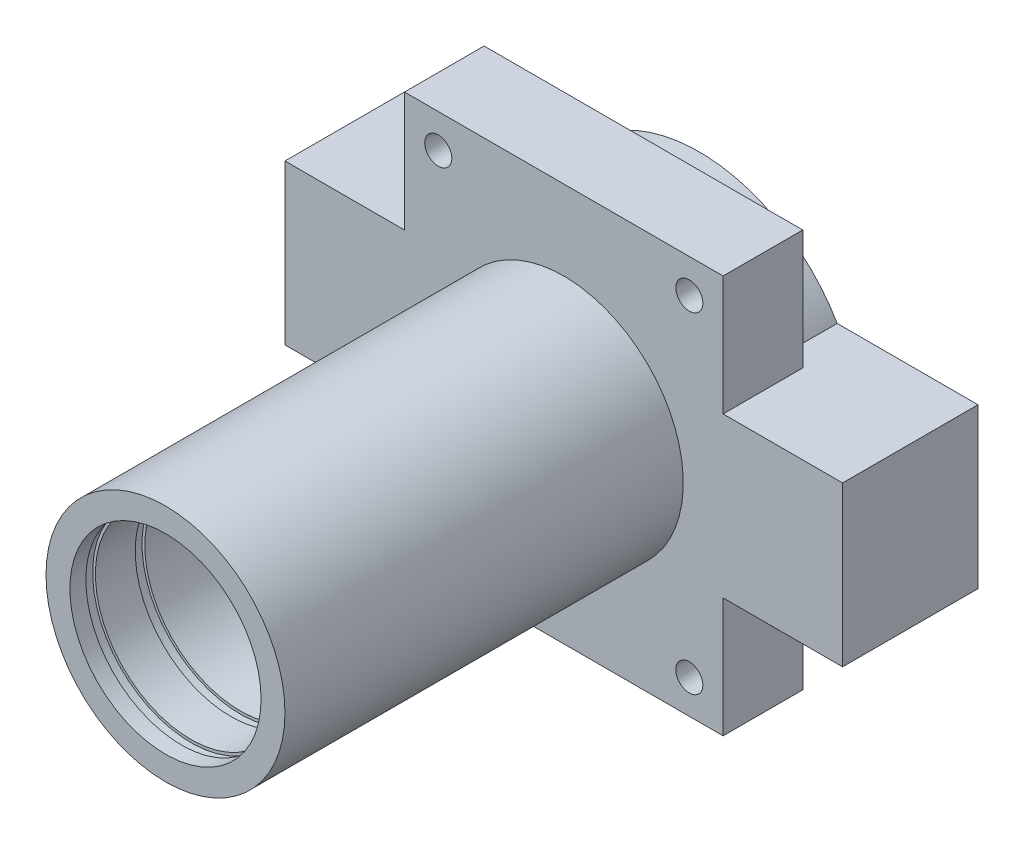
ISO-10303-21;
HEADER;
FILE_DESCRIPTION(('STEP AP214'),'2;1');
FILE_NAME('part.step','',(''),(''),'','','');
FILE_SCHEMA(('AUTOMOTIVE_DESIGN { 1 0 10303 214 1 1 1 1 }'));
ENDSEC;
DATA;
#1=APPLICATION_CONTEXT('core data for automotive mechanical design processes');
#2=APPLICATION_PROTOCOL_DEFINITION('international standard','automotive_design',2000,#1);
#3=PRODUCT_CONTEXT('',#1,'mechanical');
#4=PRODUCT('Part','Part','',(#3));
#5=PRODUCT_RELATED_PRODUCT_CATEGORY('part','',(#4));
#6=PRODUCT_DEFINITION_FORMATION('','',#4);
#7=PRODUCT_DEFINITION_CONTEXT('part definition',#1,'design');
#8=PRODUCT_DEFINITION('design','',#6,#7);
#9=PRODUCT_DEFINITION_SHAPE('','',#8);
#10=(LENGTH_UNIT() NAMED_UNIT(*) SI_UNIT(.MILLI.,.METRE.));
#11=(NAMED_UNIT(*) PLANE_ANGLE_UNIT() SI_UNIT($,.RADIAN.));
#12=(NAMED_UNIT(*) SI_UNIT($,.STERADIAN.) SOLID_ANGLE_UNIT());
#13=UNCERTAINTY_MEASURE_WITH_UNIT(LENGTH_MEASURE(1.E-05),#10,'distance_accuracy_value','');
#14=(GEOMETRIC_REPRESENTATION_CONTEXT(3) GLOBAL_UNCERTAINTY_ASSIGNED_CONTEXT((#13)) GLOBAL_UNIT_ASSIGNED_CONTEXT((#10,
#11,#12)) REPRESENTATION_CONTEXT('',''));
#15=CARTESIAN_POINT('',(0.,0.,0.));
#16=DIRECTION('',(0.,0.,1.));
#17=DIRECTION('',(1.,0.,0.));
#18=AXIS2_PLACEMENT_3D('',#15,#16,#17);
#19=CARTESIAN_POINT('',(20.,25.,60.));
#20=DIRECTION('',(0.,0.,-1.));
#21=DIRECTION('',(-1.,0.,0.));
#22=AXIS2_PLACEMENT_3D('',#19,#20,#21);
#23=CYLINDRICAL_SURFACE('',#22,12.);
#24=CARTESIAN_POINT('',(20.,25.,10.));
#25=DIRECTION('',(0.,0.,1.));
#26=DIRECTION('',(1.,0.,0.));
#27=AXIS2_PLACEMENT_3D('',#24,#25,#26);
#28=CIRCLE('',#27,12.);
#29=CARTESIAN_POINT('',(32.,25.,10.));
#30=VERTEX_POINT('',#29);
#31=EDGE_CURVE('E352',#30,#30,#28,.T.);
#32=ORIENTED_EDGE('',*,*,#31,.F.);
#33=EDGE_LOOP('',(#32));
#34=FACE_BOUND('',#33,.T.);
#35=CARTESIAN_POINT('',(20.,25.,50.6));
#36=DIRECTION('',(0.,0.,1.));
#37=DIRECTION('',(1.,0.,0.));
#38=AXIS2_PLACEMENT_3D('',#35,#36,#37);
#39=CIRCLE('',#38,12.);
#40=CARTESIAN_POINT('',(32.,25.,50.6));
#41=VERTEX_POINT('',#40);
#42=EDGE_CURVE('E46',#41,#41,#39,.T.);
#43=ORIENTED_EDGE('',*,*,#42,.T.);
#44=EDGE_LOOP('',(#43));
#45=FACE_BOUND('',#44,.T.);
#46=ADVANCED_FACE('F42',(#34,#45),#23,.F.);
#47=CARTESIAN_POINT('',(20.,25.,51.8));
#48=DIRECTION('',(0.,0.,1.));
#49=DIRECTION('',(1.,0.,0.));
#50=AXIS2_PLACEMENT_3D('',#47,#48,#49);
#51=CIRCLE('',#50,12.);
#52=CARTESIAN_POINT('',(32.,25.,51.8));
#53=VERTEX_POINT('',#52);
#54=EDGE_CURVE('E353',#53,#53,#51,.T.);
#55=ORIENTED_EDGE('',*,*,#54,.F.);
#56=EDGE_LOOP('',(#55));
#57=FACE_BOUND('',#56,.T.);
#58=CARTESIAN_POINT('',(20.,25.,56.8));
#59=DIRECTION('',(0.,0.,1.));
#60=DIRECTION('',(1.,0.,0.));
#61=AXIS2_PLACEMENT_3D('',#58,#59,#60);
#62=CIRCLE('',#61,12.);
#63=CARTESIAN_POINT('',(32.,25.,56.8));
#64=VERTEX_POINT('',#63);
#65=EDGE_CURVE('E349',#64,#64,#62,.T.);
#66=ORIENTED_EDGE('',*,*,#65,.T.);
#67=EDGE_LOOP('',(#66));
#68=FACE_BOUND('',#67,.T.);
#69=ADVANCED_FACE('F458',(#57,#68),#23,.F.);
#70=CARTESIAN_POINT('',(0.,0.,10.));
#71=DIRECTION('',(0.,0.,-1.));
#72=DIRECTION('',(-1.,0.,0.));
#73=AXIS2_PLACEMENT_3D('',#70,#71,#72);
#74=PLANE('',#73);
#75=CARTESIAN_POINT('',(20.,25.,10.));
#76=DIRECTION('',(0.,0.,-1.));
#77=DIRECTION('',(-1.,0.,0.));
#78=AXIS2_PLACEMENT_3D('',#75,#76,#77);
#79=CIRCLE('',#78,7.5);
#80=CARTESIAN_POINT('',(12.5,25.,10.));
#81=VERTEX_POINT('',#80);
#82=EDGE_CURVE('E303',#81,#81,#79,.T.);
#83=ORIENTED_EDGE('',*,*,#82,.T.);
#84=EDGE_LOOP('',(#83));
#85=FACE_BOUND('',#84,.T.);
#86=ORIENTED_EDGE('',*,*,#31,.T.);
#87=EDGE_LOOP('',(#86));
#88=FACE_BOUND('',#87,.T.);
#89=ADVANCED_FACE('F395',(#85,#88),#74,.F.);
#90=CARTESIAN_POINT('',(0.,0.,0.));
#91=DIRECTION('',(0.,0.,-1.));
#92=DIRECTION('',(-1.,0.,0.));
#93=AXIS2_PLACEMENT_3D('',#90,#91,#92);
#94=PLANE('',#93);
#95=CARTESIAN_POINT('',(4.24264068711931,4.24264068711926,0.));
#96=DIRECTION('',(0.,0.,-1.));
#97=DIRECTION('',(-1.,0.,0.));
#98=AXIS2_PLACEMENT_3D('',#95,#96,#97);
#99=CIRCLE('',#98,3.15);
#100=CARTESIAN_POINT('',(1.09264068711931,4.24264068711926,0.));
#101=VERTEX_POINT('',#100);
#102=EDGE_CURVE('E186',#101,#101,#99,.T.);
#103=ORIENTED_EDGE('',*,*,#102,.F.);
#104=EDGE_LOOP('',(#103));
#105=FACE_BOUND('',#104,.T.);
#106=CARTESIAN_POINT('',(35.7573593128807,4.24264068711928,0.));
#107=DIRECTION('',(0.,0.,-1.));
#108=DIRECTION('',(-1.,0.,0.));
#109=AXIS2_PLACEMENT_3D('',#106,#107,#108);
#110=CIRCLE('',#109,3.15);
#111=CARTESIAN_POINT('',(32.6073593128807,4.24264068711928,0.));
#112=VERTEX_POINT('',#111);
#113=EDGE_CURVE('E195',#112,#112,#110,.T.);
#114=ORIENTED_EDGE('',*,*,#113,.F.);
#115=EDGE_LOOP('',(#114));
#116=FACE_BOUND('',#115,.T.);
#117=CARTESIAN_POINT('',(20.,25.,0.));
#118=DIRECTION('',(0.,0.,-1.));
#119=DIRECTION('',(-1.,0.,0.));
#120=AXIS2_PLACEMENT_3D('',#117,#118,#119);
#121=CIRCLE('',#120,20.);
#122=CARTESIAN_POINT('',(37.3205080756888,15.,0.));
#123=VERTEX_POINT('',#122);
#124=CARTESIAN_POINT('',(2.67949192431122,15.,0.));
#125=VERTEX_POINT('',#124);
#126=EDGE_CURVE('E305',#123,#125,#121,.T.);
#127=ORIENTED_EDGE('',*,*,#126,.F.);
#128=DIRECTION('',(-1.,0.,0.));
#129=VECTOR('',#128,1.);
#130=CARTESIAN_POINT('',(40.,15.,0.));
#131=LINE('',#130,#129);
#132=CARTESIAN_POINT('',(40.,15.,0.));
#133=VERTEX_POINT('',#132);
#134=EDGE_CURVE('E222',#133,#123,#131,.T.);
#135=ORIENTED_EDGE('',*,*,#134,.F.);
#136=DIRECTION('',(0.,1.,0.));
#137=VECTOR('',#136,1.);
#138=CARTESIAN_POINT('',(40.,0.,0.));
#139=LINE('',#138,#137);
#140=CARTESIAN_POINT('',(40.,0.,0.));
#141=VERTEX_POINT('',#140);
#142=EDGE_CURVE('E328',#141,#133,#139,.T.);
#143=ORIENTED_EDGE('',*,*,#142,.F.);
#144=DIRECTION('',(1.,0.,0.));
#145=VECTOR('',#144,1.);
#146=CARTESIAN_POINT('',(0.,0.,0.));
#147=LINE('',#146,#145);
#148=CARTESIAN_POINT('',(0.,0.,0.));
#149=VERTEX_POINT('',#148);
#150=EDGE_CURVE('E325',#149,#141,#147,.T.);
#151=ORIENTED_EDGE('',*,*,#150,.F.);
#152=DIRECTION('',(0.,-1.,0.));
#153=VECTOR('',#152,1.);
#154=CARTESIAN_POINT('',(0.,0.,0.));
#155=LINE('',#154,#153);
#156=CARTESIAN_POINT('',(0.,15.,0.));
#157=VERTEX_POINT('',#156);
#158=EDGE_CURVE('E308',#157,#149,#155,.T.);
#159=ORIENTED_EDGE('',*,*,#158,.F.);
#160=DIRECTION('',(1.,0.,0.));
#161=VECTOR('',#160,1.);
#162=CARTESIAN_POINT('',(0.,15.,0.));
#163=LINE('',#162,#161);
#164=EDGE_CURVE('E238',#157,#125,#163,.T.);
#165=ORIENTED_EDGE('',*,*,#164,.T.);
#166=EDGE_LOOP('',(#127,#135,#143,#151,#159,#165));
#167=FACE_BOUND('',#166,.T.);
#168=ADVANCED_FACE('F428',(#105,#116,#167),#94,.T.);
#169=CARTESIAN_POINT('',(20.,25.,-7.));
#170=DIRECTION('',(0.,0.,1.));
#171=DIRECTION('',(1.,0.,0.));
#172=AXIS2_PLACEMENT_3D('',#169,#170,#171);
#173=CYLINDRICAL_SURFACE('',#172,20.);
#174=DIRECTION('',(0.,0.,1.));
#175=VECTOR('',#174,1.);
#176=CARTESIAN_POINT('',(37.3205080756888,15.,-7.));
#177=LINE('',#176,#175);
#178=CARTESIAN_POINT('',(37.3205080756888,15.,-7.));
#179=VERTEX_POINT('',#178);
#180=EDGE_CURVE('E236',#179,#123,#177,.T.);
#181=ORIENTED_EDGE('',*,*,#180,.T.);
#182=ORIENTED_EDGE('',*,*,#126,.T.);
#183=DIRECTION('',(0.,0.,1.));
#184=VECTOR('',#183,1.);
#185=CARTESIAN_POINT('',(2.67949192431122,15.,-7.));
#186=LINE('',#185,#184);
#187=CARTESIAN_POINT('',(2.67949192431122,15.,-7.));
#188=VERTEX_POINT('',#187);
#189=EDGE_CURVE('E248',#188,#125,#186,.T.);
#190=ORIENTED_EDGE('',*,*,#189,.F.);
#191=CARTESIAN_POINT('',(20.,25.,-7.));
#192=DIRECTION('',(0.,0.,-1.));
#193=DIRECTION('',(-1.,0.,0.));
#194=AXIS2_PLACEMENT_3D('',#191,#192,#193);
#195=CIRCLE('',#194,20.);
#196=EDGE_CURVE('E59',#179,#188,#195,.T.);
#197=ORIENTED_EDGE('',*,*,#196,.F.);
#198=EDGE_LOOP('',(#181,#182,#190,#197));
#199=FACE_BOUND('',#198,.T.);
#200=ADVANCED_FACE('F424',(#199),#173,.T.);
#201=CARTESIAN_POINT('',(40.,0.,10.));
#202=DIRECTION('',(-1.,0.,0.));
#203=DIRECTION('',(0.,0.,1.));
#204=AXIS2_PLACEMENT_3D('',#201,#202,#203);
#205=PLANE('',#204);
#206=DIRECTION('',(0.,1.,0.));
#207=VECTOR('',#206,1.);
#208=CARTESIAN_POINT('',(40.,0.,10.));
#209=LINE('',#208,#207);
#210=CARTESIAN_POINT('',(40.,35.,10.));
#211=VERTEX_POINT('',#210);
#212=CARTESIAN_POINT('',(40.,50.,10.));
#213=VERTEX_POINT('',#212);
#214=EDGE_CURVE('E315',#211,#213,#209,.T.);
#215=ORIENTED_EDGE('',*,*,#214,.F.);
#216=DIRECTION('',(0.,0.,-1.));
#217=VECTOR('',#216,1.);
#218=CARTESIAN_POINT('',(40.,35.,0.));
#219=LINE('',#218,#217);
#220=CARTESIAN_POINT('',(40.,35.,0.));
#221=VERTEX_POINT('',#220);
#222=EDGE_CURVE('E257',#211,#221,#219,.T.);
#223=ORIENTED_EDGE('',*,*,#222,.T.);
#224=CARTESIAN_POINT('',(40.,50.,0.));
#225=VERTEX_POINT('',#224);
#226=EDGE_CURVE('E327',#221,#225,#139,.T.);
#227=ORIENTED_EDGE('',*,*,#226,.T.);
#228=DIRECTION('',(0.,0.,-1.));
#229=VECTOR('',#228,1.);
#230=CARTESIAN_POINT('',(40.,50.,10.));
#231=LINE('',#230,#229);
#232=EDGE_CURVE('E335',#213,#225,#231,.T.);
#233=ORIENTED_EDGE('',*,*,#232,.F.);
#234=EDGE_LOOP('',(#215,#223,#227,#233));
#235=FACE_BOUND('',#234,.T.);
#236=ADVANCED_FACE('F456',(#235),#205,.F.);
#237=CARTESIAN_POINT('',(0.,0.,10.));
#238=DIRECTION('',(1.,0.,0.));
#239=DIRECTION('',(0.,0.,-1.));
#240=AXIS2_PLACEMENT_3D('',#237,#238,#239);
#241=PLANE('',#240);
#242=DIRECTION('',(0.,0.,-1.));
#243=VECTOR('',#242,1.);
#244=CARTESIAN_POINT('',(0.,35.,0.));
#245=LINE('',#244,#243);
#246=CARTESIAN_POINT('',(0.,35.,10.));
#247=VERTEX_POINT('',#246);
#248=CARTESIAN_POINT('',(0.,35.,0.));
#249=VERTEX_POINT('',#248);
#250=EDGE_CURVE('E276',#247,#249,#245,.T.);
#251=ORIENTED_EDGE('',*,*,#250,.F.);
#252=DIRECTION('',(0.,-1.,0.));
#253=VECTOR('',#252,1.);
#254=CARTESIAN_POINT('',(0.,0.,10.));
#255=LINE('',#254,#253);
#256=CARTESIAN_POINT('',(0.,50.,10.));
#257=VERTEX_POINT('',#256);
#258=EDGE_CURVE('E309',#257,#247,#255,.T.);
#259=ORIENTED_EDGE('',*,*,#258,.F.);
#260=DIRECTION('',(0.,0.,-1.));
#261=VECTOR('',#260,1.);
#262=CARTESIAN_POINT('',(0.,50.,10.));
#263=LINE('',#262,#261);
#264=CARTESIAN_POINT('',(0.,50.,0.));
#265=VERTEX_POINT('',#264);
#266=EDGE_CURVE('E321',#257,#265,#263,.T.);
#267=ORIENTED_EDGE('',*,*,#266,.T.);
#268=EDGE_CURVE('E322',#265,#249,#155,.T.);
#269=ORIENTED_EDGE('',*,*,#268,.T.);
#270=EDGE_LOOP('',(#251,#259,#267,#269));
#271=FACE_BOUND('',#270,.T.);
#272=ADVANCED_FACE('F44',(#271),#241,.F.);
#273=DIRECTION('',(0.,0.,1.));
#274=VECTOR('',#273,1.);
#275=CARTESIAN_POINT('',(0.,15.,10.));
#276=LINE('',#275,#274);
#277=CARTESIAN_POINT('',(0.,15.,10.));
#278=VERTEX_POINT('',#277);
#279=EDGE_CURVE('E280',#157,#278,#276,.T.);
#280=ORIENTED_EDGE('',*,*,#279,.F.);
#281=ORIENTED_EDGE('',*,*,#158,.T.);
#282=DIRECTION('',(0.,0.,-1.));
#283=VECTOR('',#282,1.);
#284=CARTESIAN_POINT('',(0.,0.,10.));
#285=LINE('',#284,#283);
#286=CARTESIAN_POINT('',(0.,0.,10.));
#287=VERTEX_POINT('',#286);
#288=EDGE_CURVE('E341',#287,#149,#285,.T.);
#289=ORIENTED_EDGE('',*,*,#288,.F.);
#290=EDGE_CURVE('E313',#278,#287,#255,.T.);
#291=ORIENTED_EDGE('',*,*,#290,.F.);
#292=EDGE_LOOP('',(#280,#281,#289,#291));
#293=FACE_BOUND('',#292,.T.);
#294=ADVANCED_FACE('F447',(#293),#241,.F.);
#295=CARTESIAN_POINT('',(20.,25.,10.));
#296=DIRECTION('',(0.,0.,-1.));
#297=DIRECTION('',(-1.,0.,0.));
#298=AXIS2_PLACEMENT_3D('',#295,#296,#297);
#299=CYLINDRICAL_SURFACE('',#298,7.5);
#300=ORIENTED_EDGE('',*,*,#82,.F.);
#301=EDGE_LOOP('',(#300));
#302=FACE_BOUND('',#301,.T.);
#303=CARTESIAN_POINT('',(20.,25.,2.));
#304=DIRECTION('',(0.,0.,-1.));
#305=DIRECTION('',(-1.,0.,0.));
#306=AXIS2_PLACEMENT_3D('',#303,#304,#305);
#307=CIRCLE('',#306,7.5);
#308=CARTESIAN_POINT('',(12.5,25.,2.));
#309=VERTEX_POINT('',#308);
#310=EDGE_CURVE('E298',#309,#309,#307,.F.);
#311=ORIENTED_EDGE('',*,*,#310,.F.);
#312=EDGE_LOOP('',(#311));
#313=FACE_BOUND('',#312,.T.);
#314=ADVANCED_FACE('F449',(#302,#313),#299,.F.);
#315=CARTESIAN_POINT('',(0.,0.,10.));
#316=DIRECTION('',(0.,1.,0.));
#317=DIRECTION('',(0.,0.,1.));
#318=AXIS2_PLACEMENT_3D('',#315,#316,#317);
#319=PLANE('',#318);
#320=ORIENTED_EDGE('',*,*,#150,.T.);
#321=DIRECTION('',(0.,0.,-1.));
#322=VECTOR('',#321,1.);
#323=CARTESIAN_POINT('',(40.,0.,10.));
#324=LINE('',#323,#322);
#325=CARTESIAN_POINT('',(40.,0.,10.));
#326=VERTEX_POINT('',#325);
#327=EDGE_CURVE('E338',#326,#141,#324,.T.);
#328=ORIENTED_EDGE('',*,*,#327,.F.);
#329=DIRECTION('',(1.,0.,0.));
#330=VECTOR('',#329,1.);
#331=CARTESIAN_POINT('',(0.,0.,10.));
#332=LINE('',#331,#330);
#333=EDGE_CURVE('E312',#287,#326,#332,.T.);
#334=ORIENTED_EDGE('',*,*,#333,.F.);
#335=ORIENTED_EDGE('',*,*,#288,.T.);
#336=EDGE_LOOP('',(#320,#328,#334,#335));
#337=FACE_BOUND('',#336,.T.);
#338=ADVANCED_FACE('F443',(#337),#319,.F.);
#339=ORIENTED_EDGE('',*,*,#142,.T.);
#340=DIRECTION('',(0.,0.,1.));
#341=VECTOR('',#340,1.);
#342=CARTESIAN_POINT('',(40.,15.,10.));
#343=LINE('',#342,#341);
#344=CARTESIAN_POINT('',(40.,15.,10.));
#345=VERTEX_POINT('',#344);
#346=EDGE_CURVE('E261',#133,#345,#343,.T.);
#347=ORIENTED_EDGE('',*,*,#346,.T.);
#348=EDGE_CURVE('E316',#326,#345,#209,.T.);
#349=ORIENTED_EDGE('',*,*,#348,.F.);
#350=ORIENTED_EDGE('',*,*,#327,.T.);
#351=EDGE_LOOP('',(#339,#347,#349,#350));
#352=FACE_BOUND('',#351,.T.);
#353=ADVANCED_FACE('F437',(#352),#205,.F.);
#354=CARTESIAN_POINT('',(0.,50.,10.));
#355=DIRECTION('',(0.,-1.,0.));
#356=DIRECTION('',(0.,0.,-1.));
#357=AXIS2_PLACEMENT_3D('',#354,#355,#356);
#358=PLANE('',#357);
#359=DIRECTION('',(-1.,0.,0.));
#360=VECTOR('',#359,1.);
#361=CARTESIAN_POINT('',(0.,50.,0.));
#362=LINE('',#361,#360);
#363=EDGE_CURVE('E331',#225,#265,#362,.T.);
#364=ORIENTED_EDGE('',*,*,#363,.T.);
#365=ORIENTED_EDGE('',*,*,#266,.F.);
#366=DIRECTION('',(-1.,0.,0.));
#367=VECTOR('',#366,1.);
#368=CARTESIAN_POINT('',(0.,50.,10.));
#369=LINE('',#368,#367);
#370=EDGE_CURVE('E319',#213,#257,#369,.T.);
#371=ORIENTED_EDGE('',*,*,#370,.F.);
#372=ORIENTED_EDGE('',*,*,#232,.T.);
#373=EDGE_LOOP('',(#364,#365,#371,#372));
#374=FACE_BOUND('',#373,.T.);
#375=ADVANCED_FACE('F393',(#374),#358,.F.);
#376=CARTESIAN_POINT('',(20.,25.,10.));
#377=DIRECTION('',(0.,0.,-1.));
#378=DIRECTION('',(-1.,0.,0.));
#379=AXIS2_PLACEMENT_3D('',#376,#377,#378);
#380=CIRCLE('',#379,15.);
#381=CARTESIAN_POINT('',(5.,25.,10.));
#382=VERTEX_POINT('',#381);
#383=EDGE_CURVE('E11',#382,#382,#380,.F.);
#384=ORIENTED_EDGE('',*,*,#383,.F.);
#385=EDGE_LOOP('',(#384));
#386=FACE_BOUND('',#385,.T.);
#387=CARTESIAN_POINT('',(4.24264068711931,4.24264068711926,10.));
#388=DIRECTION('',(0.,0.,-1.));
#389=DIRECTION('',(-1.,0.,0.));
#390=AXIS2_PLACEMENT_3D('',#387,#388,#389);
#391=CIRCLE('',#390,1.7);
#392=CARTESIAN_POINT('',(2.54264068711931,4.24264068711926,10.));
#393=VERTEX_POINT('',#392);
#394=EDGE_CURVE('E192',#393,#393,#391,.T.);
#395=ORIENTED_EDGE('',*,*,#394,.T.);
#396=EDGE_LOOP('',(#395));
#397=FACE_BOUND('',#396,.T.);
#398=CARTESIAN_POINT('',(35.7573593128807,4.24264068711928,10.));
#399=DIRECTION('',(0.,0.,-1.));
#400=DIRECTION('',(-1.,0.,0.));
#401=AXIS2_PLACEMENT_3D('',#398,#399,#400);
#402=CIRCLE('',#401,1.7);
#403=CARTESIAN_POINT('',(34.0573593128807,4.24264068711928,10.));
#404=VERTEX_POINT('',#403);
#405=EDGE_CURVE('E201',#404,#404,#402,.T.);
#406=ORIENTED_EDGE('',*,*,#405,.T.);
#407=EDGE_LOOP('',(#406));
#408=FACE_BOUND('',#407,.T.);
#409=CARTESIAN_POINT('',(35.7573593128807,45.7573593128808,10.));
#410=DIRECTION('',(0.,0.,-1.));
#411=DIRECTION('',(-1.,0.,0.));
#412=AXIS2_PLACEMENT_3D('',#409,#410,#411);
#413=CIRCLE('',#412,1.7);
#414=CARTESIAN_POINT('',(34.0573593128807,45.7573593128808,10.));
#415=VERTEX_POINT('',#414);
#416=EDGE_CURVE('E210',#415,#415,#413,.T.);
#417=ORIENTED_EDGE('',*,*,#416,.T.);
#418=EDGE_LOOP('',(#417));
#419=FACE_BOUND('',#418,.T.);
#420=CARTESIAN_POINT('',(4.2426406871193,45.7573593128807,10.));
#421=DIRECTION('',(0.,0.,-1.));
#422=DIRECTION('',(-1.,0.,0.));
#423=AXIS2_PLACEMENT_3D('',#420,#421,#422);
#424=CIRCLE('',#423,1.7);
#425=CARTESIAN_POINT('',(2.5426406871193,45.7573593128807,10.));
#426=VERTEX_POINT('',#425);
#427=EDGE_CURVE('E219',#426,#426,#424,.T.);
#428=ORIENTED_EDGE('',*,*,#427,.T.);
#429=EDGE_LOOP('',(#428));
#430=FACE_BOUND('',#429,.T.);
#431=ORIENTED_EDGE('',*,*,#258,.T.);
#432=DIRECTION('',(1.,0.,0.));
#433=VECTOR('',#432,1.);
#434=CARTESIAN_POINT('',(-15.,35.,9.99999999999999));
#435=LINE('',#434,#433);
#436=CARTESIAN_POINT('',(-15.,35.,9.99999999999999));
#437=VERTEX_POINT('',#436);
#438=EDGE_CURVE('E284',#437,#247,#435,.T.);
#439=ORIENTED_EDGE('',*,*,#438,.F.);
#440=DIRECTION('',(0.,1.,0.));
#441=VECTOR('',#440,1.);
#442=CARTESIAN_POINT('',(-15.,35.,9.99999999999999));
#443=LINE('',#442,#441);
#444=CARTESIAN_POINT('',(-15.,15.,10.));
#445=VERTEX_POINT('',#444);
#446=EDGE_CURVE('E282',#445,#437,#443,.T.);
#447=ORIENTED_EDGE('',*,*,#446,.F.);
#448=DIRECTION('',(1.,0.,0.));
#449=VECTOR('',#448,1.);
#450=CARTESIAN_POINT('',(-15.,15.,10.));
#451=LINE('',#450,#449);
#452=EDGE_CURVE('E291',#445,#278,#451,.T.);
#453=ORIENTED_EDGE('',*,*,#452,.T.);
#454=ORIENTED_EDGE('',*,*,#290,.T.);
#455=ORIENTED_EDGE('',*,*,#333,.T.);
#456=ORIENTED_EDGE('',*,*,#348,.T.);
#457=DIRECTION('',(-1.,0.,0.));
#458=VECTOR('',#457,1.);
#459=CARTESIAN_POINT('',(55.,15.,10.));
#460=LINE('',#459,#458);
#461=CARTESIAN_POINT('',(55.,15.,10.));
#462=VERTEX_POINT('',#461);
#463=EDGE_CURVE('E267',#462,#345,#460,.T.);
#464=ORIENTED_EDGE('',*,*,#463,.F.);
#465=DIRECTION('',(0.,1.,0.));
#466=VECTOR('',#465,1.);
#467=CARTESIAN_POINT('',(55.,35.,9.99999999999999));
#468=LINE('',#467,#466);
#469=CARTESIAN_POINT('',(55.,35.,9.99999999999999));
#470=VERTEX_POINT('',#469);
#471=EDGE_CURVE('E260',#462,#470,#468,.T.);
#472=ORIENTED_EDGE('',*,*,#471,.T.);
#473=DIRECTION('',(-1.,0.,0.));
#474=VECTOR('',#473,1.);
#475=CARTESIAN_POINT('',(55.,35.,9.99999999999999));
#476=LINE('',#475,#474);
#477=EDGE_CURVE('E273',#470,#211,#476,.T.);
#478=ORIENTED_EDGE('',*,*,#477,.T.);
#479=ORIENTED_EDGE('',*,*,#214,.T.);
#480=ORIENTED_EDGE('',*,*,#370,.T.);
#481=EDGE_LOOP('',(#431,#439,#447,#453,#454,#455,#456,#464,#472,#478,#479,#480));
#482=FACE_BOUND('',#481,.T.);
#483=ADVANCED_FACE('F389',(#386,#397,#408,#419,#430,#482),#74,.F.);
#484=CARTESIAN_POINT('',(35.7573593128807,45.7573593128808,0.));
#485=DIRECTION('',(0.,0.,-1.));
#486=DIRECTION('',(-1.,0.,0.));
#487=AXIS2_PLACEMENT_3D('',#484,#485,#486);
#488=CIRCLE('',#487,3.15);
#489=CARTESIAN_POINT('',(32.6073593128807,45.7573593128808,0.));
#490=VERTEX_POINT('',#489);
#491=EDGE_CURVE('E204',#490,#490,#488,.T.);
#492=ORIENTED_EDGE('',*,*,#491,.F.);
#493=EDGE_LOOP('',(#492));
#494=FACE_BOUND('',#493,.T.);
#495=CARTESIAN_POINT('',(4.2426406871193,45.7573593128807,0.));
#496=DIRECTION('',(0.,0.,-1.));
#497=DIRECTION('',(-1.,0.,0.));
#498=AXIS2_PLACEMENT_3D('',#495,#496,#497);
#499=CIRCLE('',#498,3.15);
#500=CARTESIAN_POINT('',(1.0926406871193,45.7573593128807,0.));
#501=VERTEX_POINT('',#500);
#502=EDGE_CURVE('E213',#501,#501,#499,.T.);
#503=ORIENTED_EDGE('',*,*,#502,.F.);
#504=EDGE_LOOP('',(#503));
#505=FACE_BOUND('',#504,.T.);
#506=DIRECTION('',(-1.,0.,0.));
#507=VECTOR('',#506,1.);
#508=CARTESIAN_POINT('',(40.,35.,0.));
#509=LINE('',#508,#507);
#510=CARTESIAN_POINT('',(37.3205080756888,35.,0.));
#511=VERTEX_POINT('',#510);
#512=EDGE_CURVE('E226',#221,#511,#509,.T.);
#513=ORIENTED_EDGE('',*,*,#512,.T.);
#514=CARTESIAN_POINT('',(2.67949192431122,35.,0.));
#515=VERTEX_POINT('',#514);
#516=EDGE_CURVE('E51',#515,#511,#121,.T.);
#517=ORIENTED_EDGE('',*,*,#516,.F.);
#518=DIRECTION('',(1.,0.,0.));
#519=VECTOR('',#518,1.);
#520=CARTESIAN_POINT('',(0.,35.,0.));
#521=LINE('',#520,#519);
#522=EDGE_CURVE('E243',#249,#515,#521,.T.);
#523=ORIENTED_EDGE('',*,*,#522,.F.);
#524=ORIENTED_EDGE('',*,*,#268,.F.);
#525=ORIENTED_EDGE('',*,*,#363,.F.);
#526=ORIENTED_EDGE('',*,*,#226,.F.);
#527=EDGE_LOOP('',(#513,#517,#523,#524,#525,#526));
#528=FACE_BOUND('',#527,.T.);
#529=ADVANCED_FACE('F392',(#494,#505,#528),#94,.T.);
#530=CARTESIAN_POINT('',(20.,25.,-7.));
#531=DIRECTION('',(0.,0.,-1.));
#532=DIRECTION('',(-1.,0.,0.));
#533=AXIS2_PLACEMENT_3D('',#530,#531,#532);
#534=PLANE('',#533);
#535=CARTESIAN_POINT('',(47.,25.,-7.));
#536=DIRECTION('',(0.,0.,-1.));
#537=DIRECTION('',(-1.,0.,0.));
#538=AXIS2_PLACEMENT_3D('',#535,#536,#537);
#539=CIRCLE('',#538,2.75);
#540=CARTESIAN_POINT('',(44.25,25.,-7.));
#541=VERTEX_POINT('',#540);
#542=EDGE_CURVE('E174',#541,#541,#539,.T.);
#543=ORIENTED_EDGE('',*,*,#542,.F.);
#544=EDGE_LOOP('',(#543));
#545=FACE_BOUND('',#544,.T.);
#546=CARTESIAN_POINT('',(-7.,25.,-7.));
#547=DIRECTION('',(0.,0.,-1.));
#548=DIRECTION('',(-1.,0.,0.));
#549=AXIS2_PLACEMENT_3D('',#546,#547,#548);
#550=CIRCLE('',#549,2.75);
#551=CARTESIAN_POINT('',(-9.75,25.,-7.));
#552=VERTEX_POINT('',#551);
#553=EDGE_CURVE('E173',#552,#552,#550,.T.);
#554=ORIENTED_EDGE('',*,*,#553,.F.);
#555=EDGE_LOOP('',(#554));
#556=FACE_BOUND('',#555,.T.);
#557=CARTESIAN_POINT('',(20.,25.,-7.));
#558=DIRECTION('',(0.,0.,-1.));
#559=DIRECTION('',(-1.,0.,0.));
#560=AXIS2_PLACEMENT_3D('',#557,#558,#559);
#561=CIRCLE('',#560,18.5);
#562=CARTESIAN_POINT('',(1.5,25.,-7.));
#563=VERTEX_POINT('',#562);
#564=EDGE_CURVE('E294',#563,#563,#561,.T.);
#565=ORIENTED_EDGE('',*,*,#564,.F.);
#566=EDGE_LOOP('',(#565));
#567=FACE_BOUND('',#566,.T.);
#568=CARTESIAN_POINT('',(2.67949192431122,35.,-7.));
#569=VERTEX_POINT('',#568);
#570=CARTESIAN_POINT('',(37.3205080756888,35.,-7.));
#571=VERTEX_POINT('',#570);
#572=EDGE_CURVE('E301',#569,#571,#195,.T.);
#573=ORIENTED_EDGE('',*,*,#572,.T.);
#574=DIRECTION('',(-1.,0.,0.));
#575=VECTOR('',#574,1.);
#576=CARTESIAN_POINT('',(40.,35.,-7.));
#577=LINE('',#576,#575);
#578=CARTESIAN_POINT('',(55.,35.,-7.));
#579=VERTEX_POINT('',#578);
#580=EDGE_CURVE('E225',#579,#571,#577,.T.);
#581=ORIENTED_EDGE('',*,*,#580,.F.);
#582=DIRECTION('',(0.,1.,0.));
#583=VECTOR('',#582,1.);
#584=CARTESIAN_POINT('',(55.,0.,-7.));
#585=LINE('',#584,#583);
#586=CARTESIAN_POINT('',(55.,15.,-7.));
#587=VERTEX_POINT('',#586);
#588=EDGE_CURVE('E229',#587,#579,#585,.T.);
#589=ORIENTED_EDGE('',*,*,#588,.F.);
#590=DIRECTION('',(-1.,0.,0.));
#591=VECTOR('',#590,1.);
#592=CARTESIAN_POINT('',(40.,15.,-7.));
#593=LINE('',#592,#591);
#594=EDGE_CURVE('E223',#587,#179,#593,.T.);
#595=ORIENTED_EDGE('',*,*,#594,.T.);
#596=ORIENTED_EDGE('',*,*,#196,.T.);
#597=DIRECTION('',(1.,0.,0.));
#598=VECTOR('',#597,1.);
#599=CARTESIAN_POINT('',(0.,15.,-7.));
#600=LINE('',#599,#598);
#601=CARTESIAN_POINT('',(-15.,15.,-7.));
#602=VERTEX_POINT('',#601);
#603=EDGE_CURVE('E239',#602,#188,#600,.T.);
#604=ORIENTED_EDGE('',*,*,#603,.F.);
#605=DIRECTION('',(0.,1.,0.));
#606=VECTOR('',#605,1.);
#607=CARTESIAN_POINT('',(-15.,0.,-7.));
#608=LINE('',#607,#606);
#609=CARTESIAN_POINT('',(-15.,35.,-7.));
#610=VERTEX_POINT('',#609);
#611=EDGE_CURVE('E242',#602,#610,#608,.T.);
#612=ORIENTED_EDGE('',*,*,#611,.T.);
#613=DIRECTION('',(1.,0.,0.));
#614=VECTOR('',#613,1.);
#615=CARTESIAN_POINT('',(0.,35.,-7.));
#616=LINE('',#615,#614);
#617=EDGE_CURVE('E246',#610,#569,#616,.T.);
#618=ORIENTED_EDGE('',*,*,#617,.T.);
#619=EDGE_LOOP('',(#573,#581,#589,#595,#596,#604,#612,#618));
#620=FACE_BOUND('',#619,.T.);
#621=ADVANCED_FACE('F420',(#545,#556,#567,#620),#534,.T.);
#622=ORIENTED_EDGE('',*,*,#516,.T.);
#623=DIRECTION('',(0.,0.,1.));
#624=VECTOR('',#623,1.);
#625=CARTESIAN_POINT('',(37.3205080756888,35.,-7.));
#626=LINE('',#625,#624);
#627=EDGE_CURVE('E67',#571,#511,#626,.T.);
#628=ORIENTED_EDGE('',*,*,#627,.F.);
#629=ORIENTED_EDGE('',*,*,#572,.F.);
#630=DIRECTION('',(0.,0.,1.));
#631=VECTOR('',#630,1.);
#632=CARTESIAN_POINT('',(2.67949192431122,35.,-7.));
#633=LINE('',#632,#631);
#634=EDGE_CURVE('E254',#569,#515,#633,.T.);
#635=ORIENTED_EDGE('',*,*,#634,.T.);
#636=EDGE_LOOP('',(#622,#628,#629,#635));
#637=FACE_BOUND('',#636,.T.);
#638=ADVANCED_FACE('F545',(#637),#173,.T.);
#639=CARTESIAN_POINT('',(20.,25.,2.));
#640=DIRECTION('',(0.,0.,-1.));
#641=DIRECTION('',(-1.,0.,0.));
#642=AXIS2_PLACEMENT_3D('',#639,#640,#641);
#643=PLANE('',#642);
#644=CARTESIAN_POINT('',(20.,25.,2.));
#645=DIRECTION('',(0.,0.,-1.));
#646=DIRECTION('',(-1.,0.,0.));
#647=AXIS2_PLACEMENT_3D('',#644,#645,#646);
#648=CIRCLE('',#647,18.5);
#649=CARTESIAN_POINT('',(1.5,25.,2.));
#650=VERTEX_POINT('',#649);
#651=EDGE_CURVE('E295',#650,#650,#648,.T.);
#652=ORIENTED_EDGE('',*,*,#651,.T.);
#653=EDGE_LOOP('',(#652));
#654=FACE_BOUND('',#653,.T.);
#655=ORIENTED_EDGE('',*,*,#310,.T.);
#656=EDGE_LOOP('',(#655));
#657=FACE_BOUND('',#656,.T.);
#658=ADVANCED_FACE('F542',(#654,#657),#643,.T.);
#659=CARTESIAN_POINT('',(20.,25.,2.));
#660=DIRECTION('',(0.,0.,-1.));
#661=DIRECTION('',(-1.,0.,0.));
#662=AXIS2_PLACEMENT_3D('',#659,#660,#661);
#663=CYLINDRICAL_SURFACE('',#662,18.5);
#664=ORIENTED_EDGE('',*,*,#651,.F.);
#665=EDGE_LOOP('',(#664));
#666=FACE_BOUND('',#665,.T.);
#667=ORIENTED_EDGE('',*,*,#564,.T.);
#668=EDGE_LOOP('',(#667));
#669=FACE_BOUND('',#668,.T.);
#670=ADVANCED_FACE('F541',(#666,#669),#663,.F.);
#671=CARTESIAN_POINT('',(-15.,35.,0.));
#672=DIRECTION('',(0.,-1.,0.));
#673=DIRECTION('',(0.,0.,-1.));
#674=AXIS2_PLACEMENT_3D('',#671,#672,#673);
#675=PLANE('',#674);
#676=ORIENTED_EDGE('',*,*,#250,.T.);
#677=ORIENTED_EDGE('',*,*,#522,.T.);
#678=ORIENTED_EDGE('',*,*,#634,.F.);
#679=ORIENTED_EDGE('',*,*,#617,.F.);
#680=DIRECTION('',(0.,0.,-1.));
#681=VECTOR('',#680,1.);
#682=CARTESIAN_POINT('',(-15.,35.,0.));
#683=LINE('',#682,#681);
#684=EDGE_CURVE('E277',#437,#610,#683,.T.);
#685=ORIENTED_EDGE('',*,*,#684,.F.);
#686=ORIENTED_EDGE('',*,*,#438,.T.);
#687=EDGE_LOOP('',(#676,#677,#678,#679,#685,#686));
#688=FACE_BOUND('',#687,.T.);
#689=ADVANCED_FACE('F412',(#688),#675,.F.);
#690=CARTESIAN_POINT('',(-15.,15.,10.));
#691=DIRECTION('',(0.,1.,0.));
#692=DIRECTION('',(0.,0.,1.));
#693=AXIS2_PLACEMENT_3D('',#690,#691,#692);
#694=PLANE('',#693);
#695=ORIENTED_EDGE('',*,*,#279,.T.);
#696=ORIENTED_EDGE('',*,*,#452,.F.);
#697=DIRECTION('',(0.,0.,1.));
#698=VECTOR('',#697,1.);
#699=CARTESIAN_POINT('',(-15.,15.,10.));
#700=LINE('',#699,#698);
#701=EDGE_CURVE('E279',#602,#445,#700,.T.);
#702=ORIENTED_EDGE('',*,*,#701,.F.);
#703=ORIENTED_EDGE('',*,*,#603,.T.);
#704=ORIENTED_EDGE('',*,*,#189,.T.);
#705=ORIENTED_EDGE('',*,*,#164,.F.);
#706=EDGE_LOOP('',(#695,#696,#702,#703,#704,#705));
#707=FACE_BOUND('',#706,.T.);
#708=ADVANCED_FACE('F422',(#707),#694,.F.);
#709=CARTESIAN_POINT('',(-15.,0.,0.));
#710=DIRECTION('',(1.,0.,0.));
#711=DIRECTION('',(0.,0.,-1.));
#712=AXIS2_PLACEMENT_3D('',#709,#710,#711);
#713=PLANE('',#712);
#714=ORIENTED_EDGE('',*,*,#684,.T.);
#715=ORIENTED_EDGE('',*,*,#611,.F.);
#716=ORIENTED_EDGE('',*,*,#701,.T.);
#717=ORIENTED_EDGE('',*,*,#446,.T.);
#718=EDGE_LOOP('',(#714,#715,#716,#717));
#719=FACE_BOUND('',#718,.T.);
#720=ADVANCED_FACE('F417',(#719),#713,.F.);
#721=CARTESIAN_POINT('',(55.,35.,0.));
#722=DIRECTION('',(0.,1.,0.));
#723=DIRECTION('',(0.,0.,1.));
#724=AXIS2_PLACEMENT_3D('',#721,#722,#723);
#725=PLANE('',#724);
#726=ORIENTED_EDGE('',*,*,#222,.F.);
#727=ORIENTED_EDGE('',*,*,#477,.F.);
#728=DIRECTION('',(0.,0.,-1.));
#729=VECTOR('',#728,1.);
#730=CARTESIAN_POINT('',(55.,35.,0.));
#731=LINE('',#730,#729);
#732=EDGE_CURVE('E258',#470,#579,#731,.T.);
#733=ORIENTED_EDGE('',*,*,#732,.T.);
#734=ORIENTED_EDGE('',*,*,#580,.T.);
#735=ORIENTED_EDGE('',*,*,#627,.T.);
#736=ORIENTED_EDGE('',*,*,#512,.F.);
#737=EDGE_LOOP('',(#726,#727,#733,#734,#735,#736));
#738=FACE_BOUND('',#737,.T.);
#739=ADVANCED_FACE('F531',(#738),#725,.T.);
#740=CARTESIAN_POINT('',(55.,15.,10.));
#741=DIRECTION('',(0.,-1.,0.));
#742=DIRECTION('',(0.,0.,-1.));
#743=AXIS2_PLACEMENT_3D('',#740,#741,#742);
#744=PLANE('',#743);
#745=ORIENTED_EDGE('',*,*,#346,.F.);
#746=ORIENTED_EDGE('',*,*,#134,.T.);
#747=ORIENTED_EDGE('',*,*,#180,.F.);
#748=ORIENTED_EDGE('',*,*,#594,.F.);
#749=DIRECTION('',(0.,0.,1.));
#750=VECTOR('',#749,1.);
#751=CARTESIAN_POINT('',(55.,15.,10.));
#752=LINE('',#751,#750);
#753=EDGE_CURVE('E264',#587,#462,#752,.T.);
#754=ORIENTED_EDGE('',*,*,#753,.T.);
#755=ORIENTED_EDGE('',*,*,#463,.T.);
#756=EDGE_LOOP('',(#745,#746,#747,#748,#754,#755));
#757=FACE_BOUND('',#756,.T.);
#758=ADVANCED_FACE('F433',(#757),#744,.T.);
#759=CARTESIAN_POINT('',(55.,0.,0.));
#760=DIRECTION('',(-1.,0.,0.));
#761=DIRECTION('',(0.,0.,-1.));
#762=AXIS2_PLACEMENT_3D('',#759,#760,#761);
#763=PLANE('',#762);
#764=ORIENTED_EDGE('',*,*,#732,.F.);
#765=ORIENTED_EDGE('',*,*,#471,.F.);
#766=ORIENTED_EDGE('',*,*,#753,.F.);
#767=ORIENTED_EDGE('',*,*,#588,.T.);
#768=EDGE_LOOP('',(#764,#765,#766,#767));
#769=FACE_BOUND('',#768,.T.);
#770=ADVANCED_FACE('F524',(#769),#763,.F.);
#771=CARTESIAN_POINT('',(4.2426406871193,45.7573593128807,0.));
#772=DIRECTION('',(0.,0.,-1.));
#773=DIRECTION('',(-1.,0.,0.));
#774=AXIS2_PLACEMENT_3D('',#771,#772,#773);
#775=CYLINDRICAL_SURFACE('',#774,1.7);
#776=ORIENTED_EDGE('',*,*,#427,.F.);
#777=EDGE_LOOP('',(#776));
#778=FACE_BOUND('',#777,.T.);
#779=CARTESIAN_POINT('',(4.2426406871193,45.7573593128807,1.45));
#780=DIRECTION('',(0.,0.,-1.));
#781=DIRECTION('',(-1.,0.,0.));
#782=AXIS2_PLACEMENT_3D('',#779,#780,#781);
#783=CIRCLE('',#782,1.7);
#784=CARTESIAN_POINT('',(2.5426406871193,45.7573593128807,1.45));
#785=VERTEX_POINT('',#784);
#786=EDGE_CURVE('E216',#785,#785,#783,.T.);
#787=ORIENTED_EDGE('',*,*,#786,.T.);
#788=EDGE_LOOP('',(#787));
#789=FACE_BOUND('',#788,.T.);
#790=ADVANCED_FACE('F520',(#778,#789),#775,.F.);
#791=CARTESIAN_POINT('',(4.2426406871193,45.7573593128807,0.));
#792=DIRECTION('',(0.,0.,-1.));
#793=DIRECTION('',(-1.,0.,0.));
#794=AXIS2_PLACEMENT_3D('',#791,#792,#793);
#795=CONICAL_SURFACE('',#794,3.15,0.785398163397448);
#796=ORIENTED_EDGE('',*,*,#786,.F.);
#797=EDGE_LOOP('',(#796));
#798=FACE_BOUND('',#797,.T.);
#799=ORIENTED_EDGE('',*,*,#502,.T.);
#800=EDGE_LOOP('',(#799));
#801=FACE_BOUND('',#800,.T.);
#802=ADVANCED_FACE('F516',(#798,#801),#795,.F.);
#803=CARTESIAN_POINT('',(35.7573593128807,45.7573593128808,0.));
#804=DIRECTION('',(0.,0.,-1.));
#805=DIRECTION('',(-1.,0.,0.));
#806=AXIS2_PLACEMENT_3D('',#803,#804,#805);
#807=CYLINDRICAL_SURFACE('',#806,1.7);
#808=ORIENTED_EDGE('',*,*,#416,.F.);
#809=EDGE_LOOP('',(#808));
#810=FACE_BOUND('',#809,.T.);
#811=CARTESIAN_POINT('',(35.7573593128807,45.7573593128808,1.45));
#812=DIRECTION('',(0.,0.,-1.));
#813=DIRECTION('',(-1.,0.,0.));
#814=AXIS2_PLACEMENT_3D('',#811,#812,#813);
#815=CIRCLE('',#814,1.7);
#816=CARTESIAN_POINT('',(34.0573593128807,45.7573593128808,1.45));
#817=VERTEX_POINT('',#816);
#818=EDGE_CURVE('E207',#817,#817,#815,.T.);
#819=ORIENTED_EDGE('',*,*,#818,.T.);
#820=EDGE_LOOP('',(#819));
#821=FACE_BOUND('',#820,.T.);
#822=ADVANCED_FACE('F512',(#810,#821),#807,.F.);
#823=CARTESIAN_POINT('',(35.7573593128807,45.7573593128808,0.));
#824=DIRECTION('',(0.,0.,-1.));
#825=DIRECTION('',(-1.,0.,0.));
#826=AXIS2_PLACEMENT_3D('',#823,#824,#825);
#827=CONICAL_SURFACE('',#826,3.15,0.785398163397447);
#828=ORIENTED_EDGE('',*,*,#818,.F.);
#829=EDGE_LOOP('',(#828));
#830=FACE_BOUND('',#829,.T.);
#831=ORIENTED_EDGE('',*,*,#491,.T.);
#832=EDGE_LOOP('',(#831));
#833=FACE_BOUND('',#832,.T.);
#834=ADVANCED_FACE('F508',(#830,#833),#827,.F.);
#835=CARTESIAN_POINT('',(35.7573593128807,4.24264068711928,0.));
#836=DIRECTION('',(0.,0.,-1.));
#837=DIRECTION('',(-1.,0.,0.));
#838=AXIS2_PLACEMENT_3D('',#835,#836,#837);
#839=CYLINDRICAL_SURFACE('',#838,1.7);
#840=ORIENTED_EDGE('',*,*,#405,.F.);
#841=EDGE_LOOP('',(#840));
#842=FACE_BOUND('',#841,.T.);
#843=CARTESIAN_POINT('',(35.7573593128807,4.24264068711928,1.45));
#844=DIRECTION('',(0.,0.,-1.));
#845=DIRECTION('',(-1.,0.,0.));
#846=AXIS2_PLACEMENT_3D('',#843,#844,#845);
#847=CIRCLE('',#846,1.7);
#848=CARTESIAN_POINT('',(34.0573593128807,4.24264068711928,1.45));
#849=VERTEX_POINT('',#848);
#850=EDGE_CURVE('E198',#849,#849,#847,.T.);
#851=ORIENTED_EDGE('',*,*,#850,.T.);
#852=EDGE_LOOP('',(#851));
#853=FACE_BOUND('',#852,.T.);
#854=ADVANCED_FACE('F504',(#842,#853),#839,.F.);
#855=CARTESIAN_POINT('',(35.7573593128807,4.24264068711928,0.));
#856=DIRECTION('',(0.,0.,-1.));
#857=DIRECTION('',(-1.,0.,0.));
#858=AXIS2_PLACEMENT_3D('',#855,#856,#857);
#859=CONICAL_SURFACE('',#858,3.15,0.785398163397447);
#860=ORIENTED_EDGE('',*,*,#850,.F.);
#861=EDGE_LOOP('',(#860));
#862=FACE_BOUND('',#861,.T.);
#863=ORIENTED_EDGE('',*,*,#113,.T.);
#864=EDGE_LOOP('',(#863));
#865=FACE_BOUND('',#864,.T.);
#866=ADVANCED_FACE('F500',(#862,#865),#859,.F.);
#867=CARTESIAN_POINT('',(4.24264068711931,4.24264068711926,0.));
#868=DIRECTION('',(0.,0.,-1.));
#869=DIRECTION('',(-1.,0.,0.));
#870=AXIS2_PLACEMENT_3D('',#867,#868,#869);
#871=CYLINDRICAL_SURFACE('',#870,1.7);
#872=ORIENTED_EDGE('',*,*,#394,.F.);
#873=EDGE_LOOP('',(#872));
#874=FACE_BOUND('',#873,.T.);
#875=CARTESIAN_POINT('',(4.24264068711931,4.24264068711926,1.45));
#876=DIRECTION('',(0.,0.,-1.));
#877=DIRECTION('',(-1.,0.,0.));
#878=AXIS2_PLACEMENT_3D('',#875,#876,#877);
#879=CIRCLE('',#878,1.7);
#880=CARTESIAN_POINT('',(2.54264068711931,4.24264068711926,1.45));
#881=VERTEX_POINT('',#880);
#882=EDGE_CURVE('E189',#881,#881,#879,.T.);
#883=ORIENTED_EDGE('',*,*,#882,.T.);
#884=EDGE_LOOP('',(#883));
#885=FACE_BOUND('',#884,.T.);
#886=ADVANCED_FACE('F496',(#874,#885),#871,.F.);
#887=CARTESIAN_POINT('',(4.24264068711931,4.24264068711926,0.));
#888=DIRECTION('',(0.,0.,-1.));
#889=DIRECTION('',(-1.,0.,0.));
#890=AXIS2_PLACEMENT_3D('',#887,#888,#889);
#891=CONICAL_SURFACE('',#890,3.15,0.785398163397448);
#892=ORIENTED_EDGE('',*,*,#882,.F.);
#893=EDGE_LOOP('',(#892));
#894=FACE_BOUND('',#893,.T.);
#895=ORIENTED_EDGE('',*,*,#102,.T.);
#896=EDGE_LOOP('',(#895));
#897=FACE_BOUND('',#896,.T.);
#898=ADVANCED_FACE('F492',(#894,#897),#891,.F.);
#899=CARTESIAN_POINT('',(-7.,25.,0.));
#900=DIRECTION('',(0.,0.,-1.));
#901=DIRECTION('',(-1.,0.,0.));
#902=AXIS2_PLACEMENT_3D('',#899,#900,#901);
#903=CONICAL_SURFACE('',#902,2.75,1.02974425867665);
#904=CARTESIAN_POINT('',(-7.,25.,1.65236670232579));
#905=VERTEX_POINT('',#904);
#906=VERTEX_LOOP('',#905);
#907=FACE_BOUND('',#906,.T.);
#908=CARTESIAN_POINT('',(-7.,25.,0.));
#909=DIRECTION('',(0.,0.,-1.));
#910=DIRECTION('',(-1.,0.,0.));
#911=AXIS2_PLACEMENT_3D('',#908,#909,#910);
#912=CIRCLE('',#911,2.75);
#913=CARTESIAN_POINT('',(-9.74999999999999,25.,0.));
#914=VERTEX_POINT('',#913);
#915=EDGE_CURVE('E177',#914,#914,#912,.T.);
#916=ORIENTED_EDGE('',*,*,#915,.T.);
#917=EDGE_LOOP('',(#916));
#918=FACE_BOUND('',#917,.T.);
#919=ADVANCED_FACE('F488',(#907,#918),#903,.F.);
#920=CARTESIAN_POINT('',(-7.,25.,-7.));
#921=DIRECTION('',(0.,0.,-1.));
#922=DIRECTION('',(-1.,0.,0.));
#923=AXIS2_PLACEMENT_3D('',#920,#921,#922);
#924=CYLINDRICAL_SURFACE('',#923,2.75);
#925=ORIENTED_EDGE('',*,*,#915,.F.);
#926=EDGE_LOOP('',(#925));
#927=FACE_BOUND('',#926,.T.);
#928=ORIENTED_EDGE('',*,*,#553,.T.);
#929=EDGE_LOOP('',(#928));
#930=FACE_BOUND('',#929,.T.);
#931=ADVANCED_FACE('F167',(#927,#930),#924,.F.);
#932=CARTESIAN_POINT('',(47.,25.,0.));
#933=DIRECTION('',(0.,0.,-1.));
#934=DIRECTION('',(-1.,0.,0.));
#935=AXIS2_PLACEMENT_3D('',#932,#933,#934);
#936=CONICAL_SURFACE('',#935,2.75,1.02974425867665);
#937=CARTESIAN_POINT('',(47.,25.,1.65236670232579));
#938=VERTEX_POINT('',#937);
#939=VERTEX_LOOP('',#938);
#940=FACE_BOUND('',#939,.T.);
#941=CARTESIAN_POINT('',(47.,25.,0.));
#942=DIRECTION('',(0.,0.,-1.));
#943=DIRECTION('',(-1.,0.,0.));
#944=AXIS2_PLACEMENT_3D('',#941,#942,#943);
#945=CIRCLE('',#944,2.75);
#946=CARTESIAN_POINT('',(44.25,25.,0.));
#947=VERTEX_POINT('',#946);
#948=EDGE_CURVE('E171',#947,#947,#945,.T.);
#949=ORIENTED_EDGE('',*,*,#948,.T.);
#950=EDGE_LOOP('',(#949));
#951=FACE_BOUND('',#950,.T.);
#952=ADVANCED_FACE('F163',(#940,#951),#936,.F.);
#953=CARTESIAN_POINT('',(47.,25.,-7.));
#954=DIRECTION('',(0.,0.,-1.));
#955=DIRECTION('',(-1.,0.,0.));
#956=AXIS2_PLACEMENT_3D('',#953,#954,#955);
#957=CYLINDRICAL_SURFACE('',#956,2.75);
#958=ORIENTED_EDGE('',*,*,#948,.F.);
#959=EDGE_LOOP('',(#958));
#960=FACE_BOUND('',#959,.T.);
#961=ORIENTED_EDGE('',*,*,#542,.T.);
#962=EDGE_LOOP('',(#961));
#963=FACE_BOUND('',#962,.T.);
#964=ADVANCED_FACE('F166',(#960,#963),#957,.F.);
#965=CARTESIAN_POINT('',(20.,25.,60.));
#966=DIRECTION('',(0.,0.,1.));
#967=DIRECTION('',(1.,0.,0.));
#968=AXIS2_PLACEMENT_3D('',#965,#966,#967);
#969=PLANE('',#968);
#970=CARTESIAN_POINT('',(20.,25.,60.));
#971=DIRECTION('',(0.,0.,1.));
#972=DIRECTION('',(1.,0.,0.));
#973=AXIS2_PLACEMENT_3D('',#970,#971,#972);
#974=CIRCLE('',#973,15.);
#975=CARTESIAN_POINT('',(35.,25.,60.));
#976=VERTEX_POINT('',#975);
#977=EDGE_CURVE('E180',#976,#976,#974,.T.);
#978=ORIENTED_EDGE('',*,*,#977,.T.);
#979=EDGE_LOOP('',(#978));
#980=FACE_BOUND('',#979,.T.);
#981=CARTESIAN_POINT('',(20.,25.,60.));
#982=DIRECTION('',(0.,0.,1.));
#983=DIRECTION('',(1.,0.,0.));
#984=AXIS2_PLACEMENT_3D('',#981,#982,#983);
#985=CIRCLE('',#984,12.);
#986=CARTESIAN_POINT('',(32.,25.,60.));
#987=VERTEX_POINT('',#986);
#988=EDGE_CURVE('E372',#987,#987,#985,.T.);
#989=ORIENTED_EDGE('',*,*,#988,.F.);
#990=EDGE_LOOP('',(#989));
#991=FACE_BOUND('',#990,.T.);
#992=ADVANCED_FACE('F379',(#980,#991),#969,.T.);
#993=CARTESIAN_POINT('',(20.,25.,60.));
#994=DIRECTION('',(0.,0.,-1.));
#995=DIRECTION('',(-1.,0.,0.));
#996=AXIS2_PLACEMENT_3D('',#993,#994,#995);
#997=CYLINDRICAL_SURFACE('',#996,15.);
#998=ORIENTED_EDGE('',*,*,#977,.F.);
#999=EDGE_LOOP('',(#998));
#1000=FACE_BOUND('',#999,.T.);
#1001=ORIENTED_EDGE('',*,*,#383,.T.);
#1002=EDGE_LOOP('',(#1001));
#1003=FACE_BOUND('',#1002,.T.);
#1004=ADVANCED_FACE('F382',(#1000,#1003),#997,.T.);
#1005=CARTESIAN_POINT('',(20.,25.,58.));
#1006=DIRECTION('',(0.,0.,1.));
#1007=DIRECTION('',(1.,0.,0.));
#1008=AXIS2_PLACEMENT_3D('',#1005,#1006,#1007);
#1009=CIRCLE('',#1008,12.);
#1010=CARTESIAN_POINT('',(32.,25.,58.));
#1011=VERTEX_POINT('',#1010);
#1012=EDGE_CURVE('E346',#1011,#1011,#1009,.T.);
#1013=ORIENTED_EDGE('',*,*,#1012,.F.);
#1014=EDGE_LOOP('',(#1013));
#1015=FACE_BOUND('',#1014,.T.);
#1016=ORIENTED_EDGE('',*,*,#988,.T.);
#1017=EDGE_LOOP('',(#1016));
#1018=FACE_BOUND('',#1017,.T.);
#1019=ADVANCED_FACE('F385',(#1015,#1018),#23,.F.);
#1020=CARTESIAN_POINT('',(20.,25.,56.8));
#1021=DIRECTION('',(0.,0.,1.));
#1022=DIRECTION('',(1.,0.,0.));
#1023=AXIS2_PLACEMENT_3D('',#1020,#1021,#1022);
#1024=CYLINDRICAL_SURFACE('',#1023,12.345);
#1025=CARTESIAN_POINT('',(20.,25.,56.8));
#1026=DIRECTION('',(0.,0.,1.));
#1027=DIRECTION('',(1.,0.,0.));
#1028=AXIS2_PLACEMENT_3D('',#1025,#1026,#1027);
#1029=CIRCLE('',#1028,12.345);
#1030=CARTESIAN_POINT('',(32.345,25.,56.8));
#1031=VERTEX_POINT('',#1030);
#1032=EDGE_CURVE('E350',#1031,#1031,#1029,.T.);
#1033=ORIENTED_EDGE('',*,*,#1032,.F.);
#1034=EDGE_LOOP('',(#1033));
#1035=FACE_BOUND('',#1034,.T.);
#1036=CARTESIAN_POINT('',(20.,25.,58.));
#1037=DIRECTION('',(0.,0.,1.));
#1038=DIRECTION('',(1.,0.,0.));
#1039=AXIS2_PLACEMENT_3D('',#1036,#1037,#1038);
#1040=CIRCLE('',#1039,12.345);
#1041=CARTESIAN_POINT('',(32.345,25.,58.));
#1042=VERTEX_POINT('',#1041);
#1043=EDGE_CURVE('E359',#1042,#1042,#1040,.T.);
#1044=ORIENTED_EDGE('',*,*,#1043,.T.);
#1045=EDGE_LOOP('',(#1044));
#1046=FACE_BOUND('',#1045,.T.);
#1047=ADVANCED_FACE('F470',(#1035,#1046),#1024,.F.);
#1048=CARTESIAN_POINT('',(20.,25.,56.8));
#1049=DIRECTION('',(0.,0.,1.));
#1050=DIRECTION('',(1.,0.,0.));
#1051=AXIS2_PLACEMENT_3D('',#1048,#1049,#1050);
#1052=PLANE('',#1051);
#1053=ORIENTED_EDGE('',*,*,#65,.F.);
#1054=EDGE_LOOP('',(#1053));
#1055=FACE_BOUND('',#1054,.T.);
#1056=ORIENTED_EDGE('',*,*,#1032,.T.);
#1057=EDGE_LOOP('',(#1056));
#1058=FACE_BOUND('',#1057,.T.);
#1059=ADVANCED_FACE('F475',(#1055,#1058),#1052,.T.);
#1060=CARTESIAN_POINT('',(20.,25.,58.));
#1061=DIRECTION('',(0.,0.,1.));
#1062=DIRECTION('',(1.,0.,0.));
#1063=AXIS2_PLACEMENT_3D('',#1060,#1061,#1062);
#1064=PLANE('',#1063);
#1065=ORIENTED_EDGE('',*,*,#1012,.T.);
#1066=EDGE_LOOP('',(#1065));
#1067=FACE_BOUND('',#1066,.T.);
#1068=ORIENTED_EDGE('',*,*,#1043,.F.);
#1069=EDGE_LOOP('',(#1068));
#1070=FACE_BOUND('',#1069,.T.);
#1071=ADVANCED_FACE('F872',(#1067,#1070),#1064,.F.);
#1072=CARTESIAN_POINT('',(20.,25.,50.6));
#1073=DIRECTION('',(0.,0.,1.));
#1074=DIRECTION('',(1.,0.,0.));
#1075=AXIS2_PLACEMENT_3D('',#1072,#1073,#1074);
#1076=CYLINDRICAL_SURFACE('',#1075,12.345);
#1077=CARTESIAN_POINT('',(20.,25.,50.6));
#1078=DIRECTION('',(0.,0.,1.));
#1079=DIRECTION('',(1.,0.,0.));
#1080=AXIS2_PLACEMENT_3D('',#1077,#1078,#1079);
#1081=CIRCLE('',#1080,12.345);
#1082=CARTESIAN_POINT('',(32.345,25.,50.6));
#1083=VERTEX_POINT('',#1082);
#1084=EDGE_CURVE('E355',#1083,#1083,#1081,.T.);
#1085=ORIENTED_EDGE('',*,*,#1084,.F.);
#1086=EDGE_LOOP('',(#1085));
#1087=FACE_BOUND('',#1086,.T.);
#1088=CARTESIAN_POINT('',(20.,25.,51.8));
#1089=DIRECTION('',(0.,0.,1.));
#1090=DIRECTION('',(1.,0.,0.));
#1091=AXIS2_PLACEMENT_3D('',#1088,#1089,#1090);
#1092=CIRCLE('',#1091,12.345);
#1093=CARTESIAN_POINT('',(32.345,25.,51.8));
#1094=VERTEX_POINT('',#1093);
#1095=EDGE_CURVE('E361',#1094,#1094,#1092,.T.);
#1096=ORIENTED_EDGE('',*,*,#1095,.T.);
#1097=EDGE_LOOP('',(#1096));
#1098=FACE_BOUND('',#1097,.T.);
#1099=ADVANCED_FACE('F866',(#1087,#1098),#1076,.F.);
#1100=CARTESIAN_POINT('',(20.,25.,50.6));
#1101=DIRECTION('',(0.,0.,1.));
#1102=DIRECTION('',(1.,0.,0.));
#1103=AXIS2_PLACEMENT_3D('',#1100,#1101,#1102);
#1104=PLANE('',#1103);
#1105=ORIENTED_EDGE('',*,*,#42,.F.);
#1106=EDGE_LOOP('',(#1105));
#1107=FACE_BOUND('',#1106,.T.);
#1108=ORIENTED_EDGE('',*,*,#1084,.T.);
#1109=EDGE_LOOP('',(#1108));
#1110=FACE_BOUND('',#1109,.T.);
#1111=ADVANCED_FACE('F871',(#1107,#1110),#1104,.T.);
#1112=CARTESIAN_POINT('',(20.,25.,51.8));
#1113=DIRECTION('',(0.,0.,1.));
#1114=DIRECTION('',(1.,0.,0.));
#1115=AXIS2_PLACEMENT_3D('',#1112,#1113,#1114);
#1116=PLANE('',#1115);
#1117=ORIENTED_EDGE('',*,*,#54,.T.);
#1118=EDGE_LOOP('',(#1117));
#1119=FACE_BOUND('',#1118,.T.);
#1120=ORIENTED_EDGE('',*,*,#1095,.F.);
#1121=EDGE_LOOP('',(#1120));
#1122=FACE_BOUND('',#1121,.T.);
#1123=ADVANCED_FACE('F883',(#1119,#1122),#1116,.F.);
#1124=CLOSED_SHELL('',(#46,#69,#89,#168,#200,#236,#272,#294,#314,#338,#353,#375,#483,#529,#621,
#638,#658,#670,#689,#708,#720,#739,#758,#770,#790,#802,#822,#834,#854,#866,#886,#898,#919,#931,
#952,#964,#992,#1004,#1019,#1047,#1059,#1071,#1099,#1111,#1123));
#1125=MANIFOLD_SOLID_BREP('B2',#1124);
#1126=ADVANCED_BREP_SHAPE_REPRESENTATION('',(#18,#1125),#14);
#1127=SHAPE_DEFINITION_REPRESENTATION(#9,#1126);
ENDSEC;
END-ISO-10303-21;
